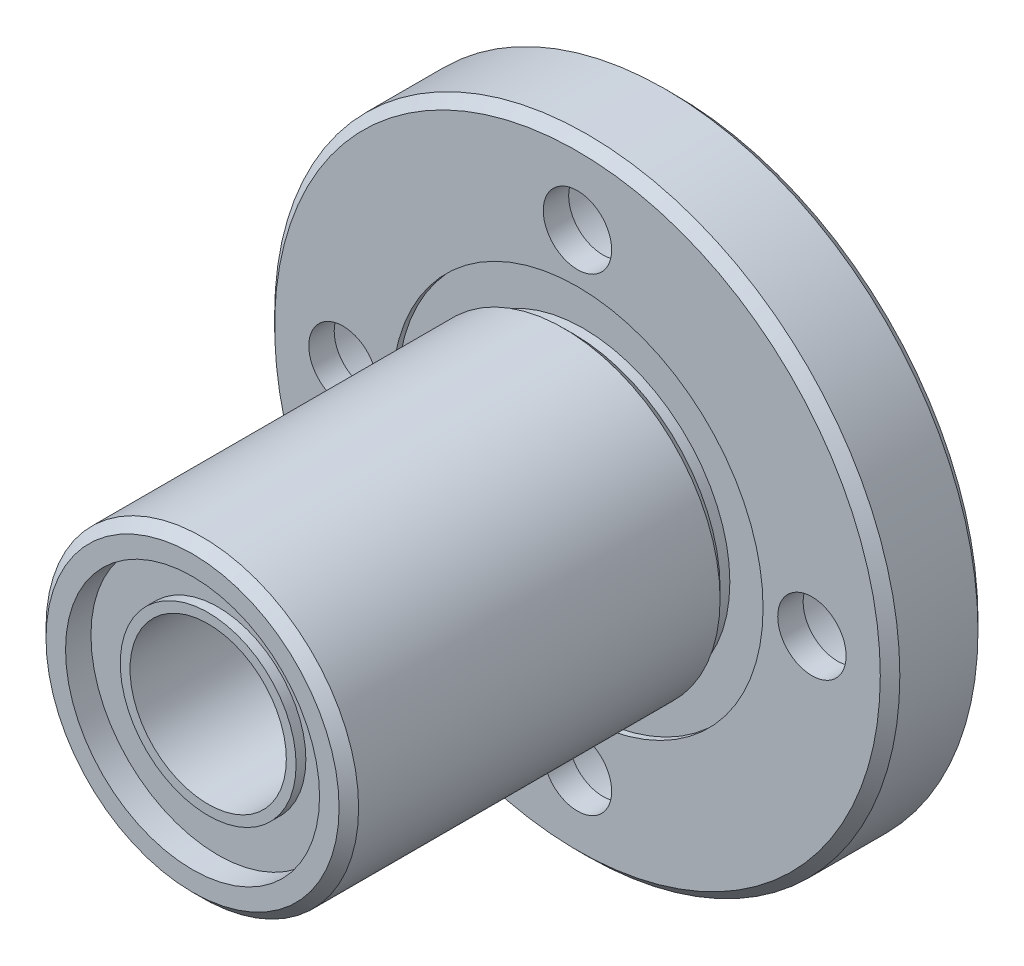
ISO-10303-21;
HEADER;
FILE_DESCRIPTION(('STEP AP214'),'2;1');
FILE_NAME('part.step','',(''),(''),'','','');
FILE_SCHEMA(('AUTOMOTIVE_DESIGN { 1 0 10303 214 1 1 1 1 }'));
ENDSEC;
DATA;
#1=APPLICATION_CONTEXT('core data for automotive mechanical design processes');
#2=APPLICATION_PROTOCOL_DEFINITION('international standard','automotive_design',2000,#1);
#3=PRODUCT_CONTEXT('',#1,'mechanical');
#4=PRODUCT('Part','Part','',(#3));
#5=PRODUCT_RELATED_PRODUCT_CATEGORY('part','',(#4));
#6=PRODUCT_DEFINITION_FORMATION('','',#4);
#7=PRODUCT_DEFINITION_CONTEXT('part definition',#1,'design');
#8=PRODUCT_DEFINITION('design','',#6,#7);
#9=PRODUCT_DEFINITION_SHAPE('','',#8);
#10=(LENGTH_UNIT() NAMED_UNIT(*) SI_UNIT(.MILLI.,.METRE.));
#11=(NAMED_UNIT(*) PLANE_ANGLE_UNIT() SI_UNIT($,.RADIAN.));
#12=(NAMED_UNIT(*) SI_UNIT($,.STERADIAN.) SOLID_ANGLE_UNIT());
#13=UNCERTAINTY_MEASURE_WITH_UNIT(LENGTH_MEASURE(1.E-05),#10,'distance_accuracy_value','');
#14=(GEOMETRIC_REPRESENTATION_CONTEXT(3) GLOBAL_UNCERTAINTY_ASSIGNED_CONTEXT((#13)) GLOBAL_UNIT_ASSIGNED_CONTEXT((#10,
#11,#12)) REPRESENTATION_CONTEXT('',''));
#15=CARTESIAN_POINT('',(0.,0.,0.));
#16=DIRECTION('',(0.,0.,1.));
#17=DIRECTION('',(1.,0.,0.));
#18=AXIS2_PLACEMENT_3D('',#15,#16,#17);
#19=CARTESIAN_POINT('',(0.,0.,23.4));
#20=DIRECTION('',(0.,0.,1.));
#21=DIRECTION('',(1.,0.,0.));
#22=AXIS2_PLACEMENT_3D('',#19,#20,#21);
#23=PLANE('',#22);
#24=CARTESIAN_POINT('',(0.,0.,23.4));
#25=DIRECTION('',(0.,0.,1.));
#26=DIRECTION('',(1.,0.,0.));
#27=AXIS2_PLACEMENT_3D('',#24,#25,#26);
#28=CIRCLE('',#27,6.5);
#29=CARTESIAN_POINT('',(6.5,0.,23.4));
#30=VERTEX_POINT('',#29);
#31=EDGE_CURVE('E93',#30,#30,#28,.T.);
#32=ORIENTED_EDGE('',*,*,#31,.T.);
#33=EDGE_LOOP('',(#32));
#34=FACE_BOUND('',#33,.T.);
#35=CARTESIAN_POINT('',(0.,0.,23.4));
#36=DIRECTION('',(0.,0.,1.));
#37=DIRECTION('',(1.,0.,0.));
#38=AXIS2_PLACEMENT_3D('',#35,#36,#37);
#39=CIRCLE('',#38,4.5);
#40=CARTESIAN_POINT('',(4.5,0.,23.4));
#41=VERTEX_POINT('',#40);
#42=EDGE_CURVE('E143',#41,#41,#39,.T.);
#43=ORIENTED_EDGE('',*,*,#42,.F.);
#44=EDGE_LOOP('',(#43));
#45=FACE_BOUND('',#44,.T.);
#46=ADVANCED_FACE('F40',(#34,#45),#23,.T.);
#47=CARTESIAN_POINT('',(0.,0.,-0.001000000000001));
#48=DIRECTION('',(0.,0.,1.));
#49=DIRECTION('',(1.,0.,0.));
#50=AXIS2_PLACEMENT_3D('',#47,#48,#49);
#51=CYLINDRICAL_SURFACE('',#50,4.);
#52=CARTESIAN_POINT('',(0.,0.,23.9));
#53=DIRECTION('',(0.,0.,1.));
#54=DIRECTION('',(1.,0.,0.));
#55=AXIS2_PLACEMENT_3D('',#52,#53,#54);
#56=CIRCLE('',#55,4.);
#57=CARTESIAN_POINT('',(4.,0.,23.9));
#58=VERTEX_POINT('',#57);
#59=EDGE_CURVE('E146',#58,#58,#56,.T.);
#60=ORIENTED_EDGE('',*,*,#59,.T.);
#61=EDGE_LOOP('',(#60));
#62=FACE_BOUND('',#61,.T.);
#63=CARTESIAN_POINT('',(0.,0.,0.8));
#64=DIRECTION('',(0.,0.,1.));
#65=DIRECTION('',(1.,0.,0.));
#66=AXIS2_PLACEMENT_3D('',#63,#64,#65);
#67=CIRCLE('',#66,4.);
#68=CARTESIAN_POINT('',(4.,0.,0.8));
#69=VERTEX_POINT('',#68);
#70=EDGE_CURVE('E155',#69,#69,#67,.T.);
#71=ORIENTED_EDGE('',*,*,#70,.F.);
#72=EDGE_LOOP('',(#71));
#73=FACE_BOUND('',#72,.T.);
#74=ADVANCED_FACE('F164',(#62,#73),#51,.F.);
#75=CARTESIAN_POINT('',(12.,0.,24.701));
#76=DIRECTION('',(0.,0.,-1.));
#77=DIRECTION('',(-1.,0.,0.));
#78=AXIS2_PLACEMENT_3D('',#75,#76,#77);
#79=CYLINDRICAL_SURFACE('',#78,1.75);
#80=CARTESIAN_POINT('',(12.,0.,5.));
#81=DIRECTION('',(0.,0.,1.));
#82=DIRECTION('',(1.,0.,0.));
#83=AXIS2_PLACEMENT_3D('',#80,#81,#82);
#84=CIRCLE('',#83,1.75);
#85=CARTESIAN_POINT('',(13.75,0.,5.));
#86=VERTEX_POINT('',#85);
#87=EDGE_CURVE('E71',#86,#86,#84,.F.);
#88=ORIENTED_EDGE('',*,*,#87,.F.);
#89=EDGE_LOOP('',(#88));
#90=FACE_BOUND('',#89,.T.);
#91=CARTESIAN_POINT('',(12.,0.,3.7));
#92=DIRECTION('',(0.,0.,-1.));
#93=DIRECTION('',(-1.,0.,0.));
#94=AXIS2_PLACEMENT_3D('',#91,#92,#93);
#95=CIRCLE('',#94,1.75);
#96=CARTESIAN_POINT('',(10.25,0.,3.7));
#97=VERTEX_POINT('',#96);
#98=EDGE_CURVE('E87',#97,#97,#95,.T.);
#99=ORIENTED_EDGE('',*,*,#98,.T.);
#100=EDGE_LOOP('',(#99));
#101=FACE_BOUND('',#100,.T.);
#102=ADVANCED_FACE('F166',(#90,#101),#79,.F.);
#103=CARTESIAN_POINT('',(0.,-12.,24.701));
#104=DIRECTION('',(0.,0.,-1.));
#105=DIRECTION('',(-1.,0.,0.));
#106=AXIS2_PLACEMENT_3D('',#103,#104,#105);
#107=CYLINDRICAL_SURFACE('',#106,1.75);
#108=CARTESIAN_POINT('',(0.,-12.,5.));
#109=DIRECTION('',(0.,0.,1.));
#110=DIRECTION('',(1.,0.,0.));
#111=AXIS2_PLACEMENT_3D('',#108,#109,#110);
#112=CIRCLE('',#111,1.75);
#113=CARTESIAN_POINT('',(1.75,-12.,5.));
#114=VERTEX_POINT('',#113);
#115=EDGE_CURVE('E74',#114,#114,#112,.F.);
#116=ORIENTED_EDGE('',*,*,#115,.F.);
#117=EDGE_LOOP('',(#116));
#118=FACE_BOUND('',#117,.T.);
#119=CARTESIAN_POINT('',(0.,-12.,3.7));
#120=DIRECTION('',(0.,0.,-1.));
#121=DIRECTION('',(-1.,0.,0.));
#122=AXIS2_PLACEMENT_3D('',#119,#120,#121);
#123=CIRCLE('',#122,1.75);
#124=CARTESIAN_POINT('',(-1.75,-12.,3.7));
#125=VERTEX_POINT('',#124);
#126=EDGE_CURVE('E90',#125,#125,#123,.T.);
#127=ORIENTED_EDGE('',*,*,#126,.T.);
#128=EDGE_LOOP('',(#127));
#129=FACE_BOUND('',#128,.T.);
#130=ADVANCED_FACE('F173',(#118,#129),#107,.F.);
#131=CARTESIAN_POINT('',(-12.,0.,24.701));
#132=DIRECTION('',(0.,0.,-1.));
#133=DIRECTION('',(-1.,0.,0.));
#134=AXIS2_PLACEMENT_3D('',#131,#132,#133);
#135=CYLINDRICAL_SURFACE('',#134,1.75);
#136=CARTESIAN_POINT('',(-12.,0.,5.));
#137=DIRECTION('',(0.,0.,1.));
#138=DIRECTION('',(1.,0.,0.));
#139=AXIS2_PLACEMENT_3D('',#136,#137,#138);
#140=CIRCLE('',#139,1.75);
#141=CARTESIAN_POINT('',(-10.25,0.,5.));
#142=VERTEX_POINT('',#141);
#143=EDGE_CURVE('E78',#142,#142,#140,.F.);
#144=ORIENTED_EDGE('',*,*,#143,.F.);
#145=EDGE_LOOP('',(#144));
#146=FACE_BOUND('',#145,.T.);
#147=CARTESIAN_POINT('',(-12.,0.,3.7));
#148=DIRECTION('',(0.,0.,-1.));
#149=DIRECTION('',(-1.,0.,0.));
#150=AXIS2_PLACEMENT_3D('',#147,#148,#149);
#151=CIRCLE('',#150,1.75);
#152=CARTESIAN_POINT('',(-13.75,0.,3.7));
#153=VERTEX_POINT('',#152);
#154=EDGE_CURVE('E100',#153,#153,#151,.T.);
#155=ORIENTED_EDGE('',*,*,#154,.T.);
#156=EDGE_LOOP('',(#155));
#157=FACE_BOUND('',#156,.T.);
#158=ADVANCED_FACE('F485',(#146,#157),#135,.F.);
#159=CARTESIAN_POINT('',(0.,12.,24.701));
#160=DIRECTION('',(0.,0.,-1.));
#161=DIRECTION('',(-1.,0.,0.));
#162=AXIS2_PLACEMENT_3D('',#159,#160,#161);
#163=CYLINDRICAL_SURFACE('',#162,1.75);
#164=CARTESIAN_POINT('',(0.,12.,5.));
#165=DIRECTION('',(0.,0.,1.));
#166=DIRECTION('',(1.,0.,0.));
#167=AXIS2_PLACEMENT_3D('',#164,#165,#166);
#168=CIRCLE('',#167,1.75);
#169=CARTESIAN_POINT('',(1.75,12.,5.));
#170=VERTEX_POINT('',#169);
#171=EDGE_CURVE('E70',#170,#170,#168,.F.);
#172=ORIENTED_EDGE('',*,*,#171,.F.);
#173=EDGE_LOOP('',(#172));
#174=FACE_BOUND('',#173,.T.);
#175=CARTESIAN_POINT('',(0.,12.,3.7));
#176=DIRECTION('',(0.,0.,-1.));
#177=DIRECTION('',(-1.,0.,0.));
#178=AXIS2_PLACEMENT_3D('',#175,#176,#177);
#179=CIRCLE('',#178,1.75);
#180=CARTESIAN_POINT('',(-1.75,12.,3.7));
#181=VERTEX_POINT('',#180);
#182=EDGE_CURVE('E109',#181,#181,#179,.T.);
#183=ORIENTED_EDGE('',*,*,#182,.T.);
#184=EDGE_LOOP('',(#183));
#185=FACE_BOUND('',#184,.T.);
#186=ADVANCED_FACE('F198',(#174,#185),#163,.F.);
#187=CARTESIAN_POINT('',(0.,0.,5.));
#188=DIRECTION('',(0.,0.,-1.));
#189=DIRECTION('',(-1.,0.,0.));
#190=AXIS2_PLACEMENT_3D('',#187,#188,#189);
#191=CYLINDRICAL_SURFACE('',#190,16.);
#192=CARTESIAN_POINT('',(0.,0.,0.499999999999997));
#193=DIRECTION('',(0.,0.,1.));
#194=DIRECTION('',(1.,0.,0.));
#195=AXIS2_PLACEMENT_3D('',#192,#193,#194);
#196=CIRCLE('',#195,16.);
#197=CARTESIAN_POINT('',(16.,0.,0.499999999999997));
#198=VERTEX_POINT('',#197);
#199=EDGE_CURVE('E52',#198,#198,#196,.T.);
#200=ORIENTED_EDGE('',*,*,#199,.T.);
#201=EDGE_LOOP('',(#200));
#202=FACE_BOUND('',#201,.T.);
#203=CARTESIAN_POINT('',(0.,0.,4.49999999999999));
#204=DIRECTION('',(0.,0.,1.));
#205=DIRECTION('',(1.,0.,0.));
#206=AXIS2_PLACEMENT_3D('',#203,#204,#205);
#207=CIRCLE('',#206,16.);
#208=CARTESIAN_POINT('',(16.,0.,4.49999999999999));
#209=VERTEX_POINT('',#208);
#210=EDGE_CURVE('E56',#209,#209,#207,.F.);
#211=ORIENTED_EDGE('',*,*,#210,.T.);
#212=EDGE_LOOP('',(#211));
#213=FACE_BOUND('',#212,.T.);
#214=ADVANCED_FACE('F193',(#202,#213),#191,.T.);
#215=CARTESIAN_POINT('',(0.,0.,5.));
#216=DIRECTION('',(0.,0.,1.));
#217=DIRECTION('',(1.,0.,0.));
#218=AXIS2_PLACEMENT_3D('',#215,#216,#217);
#219=PLANE('',#218);
#220=CARTESIAN_POINT('',(0.,0.,5.));
#221=DIRECTION('',(0.,0.,1.));
#222=DIRECTION('',(1.,0.,0.));
#223=AXIS2_PLACEMENT_3D('',#220,#221,#222);
#224=CIRCLE('',#223,15.5);
#225=CARTESIAN_POINT('',(15.5,0.,5.));
#226=VERTEX_POINT('',#225);
#227=EDGE_CURVE('E11',#226,#226,#224,.T.);
#228=ORIENTED_EDGE('',*,*,#227,.T.);
#229=EDGE_LOOP('',(#228));
#230=FACE_BOUND('',#229,.T.);
#231=CARTESIAN_POINT('',(0.,0.,5.));
#232=DIRECTION('',(0.,0.,1.));
#233=DIRECTION('',(1.,0.,0.));
#234=AXIS2_PLACEMENT_3D('',#231,#232,#233);
#235=CIRCLE('',#234,9.5);
#236=CARTESIAN_POINT('',(9.5,0.,5.));
#237=VERTEX_POINT('',#236);
#238=EDGE_CURVE('E131',#237,#237,#235,.T.);
#239=ORIENTED_EDGE('',*,*,#238,.F.);
#240=EDGE_LOOP('',(#239));
#241=FACE_BOUND('',#240,.T.);
#242=ORIENTED_EDGE('',*,*,#171,.T.);
#243=EDGE_LOOP('',(#242));
#244=FACE_BOUND('',#243,.T.);
#245=ORIENTED_EDGE('',*,*,#143,.T.);
#246=EDGE_LOOP('',(#245));
#247=FACE_BOUND('',#246,.T.);
#248=ORIENTED_EDGE('',*,*,#115,.T.);
#249=EDGE_LOOP('',(#248));
#250=FACE_BOUND('',#249,.T.);
#251=ORIENTED_EDGE('',*,*,#87,.T.);
#252=EDGE_LOOP('',(#251));
#253=FACE_BOUND('',#252,.T.);
#254=ADVANCED_FACE('F190',(#230,#241,#244,#247,#250,#253),#219,.T.);
#255=CARTESIAN_POINT('',(0.,0.,0.));
#256=DIRECTION('',(0.,0.,1.));
#257=DIRECTION('',(1.,0.,0.));
#258=AXIS2_PLACEMENT_3D('',#255,#256,#257);
#259=PLANE('',#258);
#260=CARTESIAN_POINT('',(0.,0.,0.));
#261=DIRECTION('',(0.,0.,1.));
#262=DIRECTION('',(1.,0.,0.));
#263=AXIS2_PLACEMENT_3D('',#260,#261,#262);
#264=CIRCLE('',#263,15.5);
#265=CARTESIAN_POINT('',(15.5,0.,0.));
#266=VERTEX_POINT('',#265);
#267=EDGE_CURVE('E48',#266,#266,#264,.F.);
#268=ORIENTED_EDGE('',*,*,#267,.T.);
#269=EDGE_LOOP('',(#268));
#270=FACE_BOUND('',#269,.T.);
#271=CARTESIAN_POINT('',(0.,0.,0.));
#272=DIRECTION('',(0.,0.,1.));
#273=DIRECTION('',(1.,0.,0.));
#274=AXIS2_PLACEMENT_3D('',#271,#272,#273);
#275=CIRCLE('',#274,6.5);
#276=CARTESIAN_POINT('',(6.5,0.,0.));
#277=VERTEX_POINT('',#276);
#278=EDGE_CURVE('E125',#277,#277,#275,.T.);
#279=ORIENTED_EDGE('',*,*,#278,.T.);
#280=EDGE_LOOP('',(#279));
#281=FACE_BOUND('',#280,.T.);
#282=CARTESIAN_POINT('',(0.,12.,0.));
#283=DIRECTION('',(0.,0.,-1.));
#284=DIRECTION('',(-1.,0.,0.));
#285=AXIS2_PLACEMENT_3D('',#282,#283,#284);
#286=CIRCLE('',#285,3.25);
#287=CARTESIAN_POINT('',(-3.25,12.,0.));
#288=VERTEX_POINT('',#287);
#289=EDGE_CURVE('E112',#288,#288,#286,.T.);
#290=ORIENTED_EDGE('',*,*,#289,.F.);
#291=EDGE_LOOP('',(#290));
#292=FACE_BOUND('',#291,.T.);
#293=CARTESIAN_POINT('',(-12.,0.,0.));
#294=DIRECTION('',(0.,0.,-1.));
#295=DIRECTION('',(-1.,0.,0.));
#296=AXIS2_PLACEMENT_3D('',#293,#294,#295);
#297=CIRCLE('',#296,3.25);
#298=CARTESIAN_POINT('',(-15.25,0.,0.));
#299=VERTEX_POINT('',#298);
#300=EDGE_CURVE('E103',#299,#299,#297,.T.);
#301=ORIENTED_EDGE('',*,*,#300,.F.);
#302=EDGE_LOOP('',(#301));
#303=FACE_BOUND('',#302,.T.);
#304=CARTESIAN_POINT('',(0.,-12.,0.));
#305=DIRECTION('',(0.,0.,-1.));
#306=DIRECTION('',(-1.,0.,0.));
#307=AXIS2_PLACEMENT_3D('',#304,#305,#306);
#308=CIRCLE('',#307,3.25);
#309=CARTESIAN_POINT('',(-3.25,-12.,0.));
#310=VERTEX_POINT('',#309);
#311=EDGE_CURVE('E94',#310,#310,#308,.T.);
#312=ORIENTED_EDGE('',*,*,#311,.F.);
#313=EDGE_LOOP('',(#312));
#314=FACE_BOUND('',#313,.T.);
#315=CARTESIAN_POINT('',(12.,0.,0.));
#316=DIRECTION('',(0.,0.,-1.));
#317=DIRECTION('',(-1.,0.,0.));
#318=AXIS2_PLACEMENT_3D('',#315,#316,#317);
#319=CIRCLE('',#318,3.25);
#320=CARTESIAN_POINT('',(8.75,0.,0.));
#321=VERTEX_POINT('',#320);
#322=EDGE_CURVE('E83',#321,#321,#319,.T.);
#323=ORIENTED_EDGE('',*,*,#322,.F.);
#324=EDGE_LOOP('',(#323));
#325=FACE_BOUND('',#324,.T.);
#326=ADVANCED_FACE('F188',(#270,#281,#292,#303,#314,#325),#259,.F.);
#327=CARTESIAN_POINT('',(0.,0.,24.7));
#328=DIRECTION('',(0.,0.,-1.));
#329=DIRECTION('',(-1.,0.,0.));
#330=AXIS2_PLACEMENT_3D('',#327,#328,#329);
#331=CYLINDRICAL_SURFACE('',#330,8.);
#332=CARTESIAN_POINT('',(0.,0.,24.2));
#333=DIRECTION('',(0.,0.,1.));
#334=DIRECTION('',(1.,0.,0.));
#335=AXIS2_PLACEMENT_3D('',#332,#333,#334);
#336=CIRCLE('',#335,8.);
#337=CARTESIAN_POINT('',(8.,0.,24.2));
#338=VERTEX_POINT('',#337);
#339=EDGE_CURVE('E61',#338,#338,#336,.F.);
#340=ORIENTED_EDGE('',*,*,#339,.T.);
#341=EDGE_LOOP('',(#340));
#342=FACE_BOUND('',#341,.T.);
#343=CARTESIAN_POINT('',(0.,0.,5.7));
#344=DIRECTION('',(0.,0.,1.));
#345=DIRECTION('',(1.,0.,0.));
#346=AXIS2_PLACEMENT_3D('',#343,#344,#345);
#347=CIRCLE('',#346,8.);
#348=CARTESIAN_POINT('',(8.,0.,5.7));
#349=VERTEX_POINT('',#348);
#350=EDGE_CURVE('E134',#349,#349,#347,.T.);
#351=ORIENTED_EDGE('',*,*,#350,.T.);
#352=EDGE_LOOP('',(#351));
#353=FACE_BOUND('',#352,.T.);
#354=ADVANCED_FACE('F184',(#342,#353),#331,.T.);
#355=CARTESIAN_POINT('',(0.,0.,24.7));
#356=DIRECTION('',(0.,0.,1.));
#357=DIRECTION('',(1.,0.,0.));
#358=AXIS2_PLACEMENT_3D('',#355,#356,#357);
#359=PLANE('',#358);
#360=CARTESIAN_POINT('',(0.,0.,24.7));
#361=DIRECTION('',(0.,0.,1.));
#362=DIRECTION('',(1.,0.,0.));
#363=AXIS2_PLACEMENT_3D('',#360,#361,#362);
#364=CIRCLE('',#363,7.5);
#365=CARTESIAN_POINT('',(7.5,0.,24.7));
#366=VERTEX_POINT('',#365);
#367=EDGE_CURVE('E64',#366,#366,#364,.T.);
#368=ORIENTED_EDGE('',*,*,#367,.T.);
#369=EDGE_LOOP('',(#368));
#370=FACE_BOUND('',#369,.T.);
#371=CARTESIAN_POINT('',(0.,0.,24.7));
#372=DIRECTION('',(0.,0.,1.));
#373=DIRECTION('',(1.,0.,0.));
#374=AXIS2_PLACEMENT_3D('',#371,#372,#373);
#375=CIRCLE('',#374,6.5);
#376=CARTESIAN_POINT('',(6.5,0.,24.7));
#377=VERTEX_POINT('',#376);
#378=EDGE_CURVE('E119',#377,#377,#375,.T.);
#379=ORIENTED_EDGE('',*,*,#378,.F.);
#380=EDGE_LOOP('',(#379));
#381=FACE_BOUND('',#380,.T.);
#382=ADVANCED_FACE('F180',(#370,#381),#359,.T.);
#383=CARTESIAN_POINT('',(0.,12.,3.7));
#384=DIRECTION('',(0.,0.,-1.));
#385=DIRECTION('',(-1.,0.,0.));
#386=AXIS2_PLACEMENT_3D('',#383,#384,#385);
#387=CYLINDRICAL_SURFACE('',#386,3.25);
#388=CARTESIAN_POINT('',(0.,12.,3.7));
#389=DIRECTION('',(0.,0.,-1.));
#390=DIRECTION('',(-1.,0.,0.));
#391=AXIS2_PLACEMENT_3D('',#388,#389,#390);
#392=CIRCLE('',#391,3.25);
#393=CARTESIAN_POINT('',(-3.25,12.,3.7));
#394=VERTEX_POINT('',#393);
#395=EDGE_CURVE('E75',#394,#394,#392,.T.);
#396=ORIENTED_EDGE('',*,*,#395,.F.);
#397=EDGE_LOOP('',(#396));
#398=FACE_BOUND('',#397,.T.);
#399=ORIENTED_EDGE('',*,*,#289,.T.);
#400=EDGE_LOOP('',(#399));
#401=FACE_BOUND('',#400,.T.);
#402=ADVANCED_FACE('F183',(#398,#401),#387,.F.);
#403=CARTESIAN_POINT('',(0.,12.,3.7));
#404=DIRECTION('',(0.,0.,-1.));
#405=DIRECTION('',(-1.,0.,0.));
#406=AXIS2_PLACEMENT_3D('',#403,#404,#405);
#407=PLANE('',#406);
#408=ORIENTED_EDGE('',*,*,#182,.F.);
#409=EDGE_LOOP('',(#408));
#410=FACE_BOUND('',#409,.T.);
#411=ORIENTED_EDGE('',*,*,#395,.T.);
#412=EDGE_LOOP('',(#411));
#413=FACE_BOUND('',#412,.T.);
#414=ADVANCED_FACE('F459',(#410,#413),#407,.T.);
#415=CARTESIAN_POINT('',(-12.,0.,3.7));
#416=DIRECTION('',(0.,0.,-1.));
#417=DIRECTION('',(-1.,0.,0.));
#418=AXIS2_PLACEMENT_3D('',#415,#416,#417);
#419=CYLINDRICAL_SURFACE('',#418,3.25);
#420=CARTESIAN_POINT('',(-12.,0.,3.7));
#421=DIRECTION('',(0.,0.,-1.));
#422=DIRECTION('',(-1.,0.,0.));
#423=AXIS2_PLACEMENT_3D('',#420,#421,#422);
#424=CIRCLE('',#423,3.25);
#425=CARTESIAN_POINT('',(-15.25,0.,3.7));
#426=VERTEX_POINT('',#425);
#427=EDGE_CURVE('E106',#426,#426,#424,.T.);
#428=ORIENTED_EDGE('',*,*,#427,.F.);
#429=EDGE_LOOP('',(#428));
#430=FACE_BOUND('',#429,.T.);
#431=ORIENTED_EDGE('',*,*,#300,.T.);
#432=EDGE_LOOP('',(#431));
#433=FACE_BOUND('',#432,.T.);
#434=ADVANCED_FACE('F449',(#430,#433),#419,.F.);
#435=CARTESIAN_POINT('',(-12.,0.,3.7));
#436=DIRECTION('',(0.,0.,-1.));
#437=DIRECTION('',(-1.,0.,0.));
#438=AXIS2_PLACEMENT_3D('',#435,#436,#437);
#439=PLANE('',#438);
#440=ORIENTED_EDGE('',*,*,#154,.F.);
#441=EDGE_LOOP('',(#440));
#442=FACE_BOUND('',#441,.T.);
#443=ORIENTED_EDGE('',*,*,#427,.T.);
#444=EDGE_LOOP('',(#443));
#445=FACE_BOUND('',#444,.T.);
#446=ADVANCED_FACE('F439',(#442,#445),#439,.T.);
#447=CARTESIAN_POINT('',(0.,-12.,3.7));
#448=DIRECTION('',(0.,0.,-1.));
#449=DIRECTION('',(-1.,0.,0.));
#450=AXIS2_PLACEMENT_3D('',#447,#448,#449);
#451=CYLINDRICAL_SURFACE('',#450,3.25);
#452=CARTESIAN_POINT('',(0.,-12.,3.7));
#453=DIRECTION('',(0.,0.,-1.));
#454=DIRECTION('',(-1.,0.,0.));
#455=AXIS2_PLACEMENT_3D('',#452,#453,#454);
#456=CIRCLE('',#455,3.25);
#457=CARTESIAN_POINT('',(-3.25,-12.,3.7));
#458=VERTEX_POINT('',#457);
#459=EDGE_CURVE('E97',#458,#458,#456,.T.);
#460=ORIENTED_EDGE('',*,*,#459,.F.);
#461=EDGE_LOOP('',(#460));
#462=FACE_BOUND('',#461,.T.);
#463=ORIENTED_EDGE('',*,*,#311,.T.);
#464=EDGE_LOOP('',(#463));
#465=FACE_BOUND('',#464,.T.);
#466=ADVANCED_FACE('F429',(#462,#465),#451,.F.);
#467=CARTESIAN_POINT('',(0.,-12.,3.7));
#468=DIRECTION('',(0.,0.,-1.));
#469=DIRECTION('',(-1.,0.,0.));
#470=AXIS2_PLACEMENT_3D('',#467,#468,#469);
#471=PLANE('',#470);
#472=ORIENTED_EDGE('',*,*,#126,.F.);
#473=EDGE_LOOP('',(#472));
#474=FACE_BOUND('',#473,.T.);
#475=ORIENTED_EDGE('',*,*,#459,.T.);
#476=EDGE_LOOP('',(#475));
#477=FACE_BOUND('',#476,.T.);
#478=ADVANCED_FACE('F419',(#474,#477),#471,.T.);
#479=CARTESIAN_POINT('',(12.,0.,3.7));
#480=DIRECTION('',(0.,0.,-1.));
#481=DIRECTION('',(-1.,0.,0.));
#482=AXIS2_PLACEMENT_3D('',#479,#480,#481);
#483=CYLINDRICAL_SURFACE('',#482,3.25);
#484=CARTESIAN_POINT('',(12.,0.,3.7));
#485=DIRECTION('',(0.,0.,-1.));
#486=DIRECTION('',(-1.,0.,0.));
#487=AXIS2_PLACEMENT_3D('',#484,#485,#486);
#488=CIRCLE('',#487,3.25);
#489=CARTESIAN_POINT('',(8.75,0.,3.7));
#490=VERTEX_POINT('',#489);
#491=EDGE_CURVE('E86',#490,#490,#488,.T.);
#492=ORIENTED_EDGE('',*,*,#491,.F.);
#493=EDGE_LOOP('',(#492));
#494=FACE_BOUND('',#493,.T.);
#495=ORIENTED_EDGE('',*,*,#322,.T.);
#496=EDGE_LOOP('',(#495));
#497=FACE_BOUND('',#496,.T.);
#498=ADVANCED_FACE('F409',(#494,#497),#483,.F.);
#499=CARTESIAN_POINT('',(12.,0.,3.7));
#500=DIRECTION('',(0.,0.,-1.));
#501=DIRECTION('',(-1.,0.,0.));
#502=AXIS2_PLACEMENT_3D('',#499,#500,#501);
#503=PLANE('',#502);
#504=ORIENTED_EDGE('',*,*,#98,.F.);
#505=EDGE_LOOP('',(#504));
#506=FACE_BOUND('',#505,.T.);
#507=ORIENTED_EDGE('',*,*,#491,.T.);
#508=EDGE_LOOP('',(#507));
#509=FACE_BOUND('',#508,.T.);
#510=ADVANCED_FACE('F398',(#506,#509),#503,.T.);
#511=CARTESIAN_POINT('',(0.,0.,23.4));
#512=DIRECTION('',(0.,0.,1.));
#513=DIRECTION('',(1.,0.,0.));
#514=AXIS2_PLACEMENT_3D('',#511,#512,#513);
#515=CYLINDRICAL_SURFACE('',#514,6.5);
#516=ORIENTED_EDGE('',*,*,#31,.F.);
#517=EDGE_LOOP('',(#516));
#518=FACE_BOUND('',#517,.T.);
#519=ORIENTED_EDGE('',*,*,#378,.T.);
#520=EDGE_LOOP('',(#519));
#521=FACE_BOUND('',#520,.T.);
#522=ADVANCED_FACE('F313',(#518,#521),#515,.F.);
#523=CARTESIAN_POINT('',(0.,0.,1.3));
#524=DIRECTION('',(0.,0.,1.));
#525=DIRECTION('',(1.,0.,0.));
#526=AXIS2_PLACEMENT_3D('',#523,#524,#525);
#527=PLANE('',#526);
#528=CARTESIAN_POINT('',(0.,0.,1.3));
#529=DIRECTION('',(0.,0.,1.));
#530=DIRECTION('',(1.,0.,0.));
#531=AXIS2_PLACEMENT_3D('',#528,#529,#530);
#532=CIRCLE('',#531,4.5);
#533=CARTESIAN_POINT('',(4.5,0.,1.3));
#534=VERTEX_POINT('',#533);
#535=EDGE_CURVE('E152',#534,#534,#532,.T.);
#536=ORIENTED_EDGE('',*,*,#535,.T.);
#537=EDGE_LOOP('',(#536));
#538=FACE_BOUND('',#537,.T.);
#539=CARTESIAN_POINT('',(0.,0.,1.3));
#540=DIRECTION('',(0.,0.,1.));
#541=DIRECTION('',(1.,0.,0.));
#542=AXIS2_PLACEMENT_3D('',#539,#540,#541);
#543=CIRCLE('',#542,6.5);
#544=CARTESIAN_POINT('',(6.5,0.,1.3));
#545=VERTEX_POINT('',#544);
#546=EDGE_CURVE('E122',#545,#545,#543,.T.);
#547=ORIENTED_EDGE('',*,*,#546,.F.);
#548=EDGE_LOOP('',(#547));
#549=FACE_BOUND('',#548,.T.);
#550=ADVANCED_FACE('F307',(#538,#549),#527,.F.);
#551=CARTESIAN_POINT('',(0.,0.,1.3));
#552=DIRECTION('',(0.,0.,-1.));
#553=DIRECTION('',(-1.,0.,0.));
#554=AXIS2_PLACEMENT_3D('',#551,#552,#553);
#555=CYLINDRICAL_SURFACE('',#554,6.5);
#556=ORIENTED_EDGE('',*,*,#546,.T.);
#557=EDGE_LOOP('',(#556));
#558=FACE_BOUND('',#557,.T.);
#559=ORIENTED_EDGE('',*,*,#278,.F.);
#560=EDGE_LOOP('',(#559));
#561=FACE_BOUND('',#560,.T.);
#562=ADVANCED_FACE('F312',(#558,#561),#555,.F.);
#563=CARTESIAN_POINT('',(0.,0.,-42.1700576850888));
#564=DIRECTION('',(0.,0.,1.));
#565=DIRECTION('',(1.,0.,0.));
#566=AXIS2_PLACEMENT_3D('',#563,#564,#565);
#567=CYLINDRICAL_SURFACE('',#566,9.5);
#568=CARTESIAN_POINT('',(0.,0.,4.7));
#569=DIRECTION('',(0.,0.,1.));
#570=DIRECTION('',(1.,0.,0.));
#571=AXIS2_PLACEMENT_3D('',#568,#569,#570);
#572=CIRCLE('',#571,9.5);
#573=CARTESIAN_POINT('',(9.5,0.,4.7));
#574=VERTEX_POINT('',#573);
#575=EDGE_CURVE('E128',#574,#574,#572,.F.);
#576=CARTESIAN_POINT('',(9.5,0.,4.7));
#577=CARTESIAN_POINT('',(9.5,0.,4.703125));
#578=CARTESIAN_POINT('',(9.5,0.,4.70625));
#579=CARTESIAN_POINT('',(9.5,0.,4.71249999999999));
#580=CARTESIAN_POINT('',(9.5,0.,4.71562499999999));
#581=CARTESIAN_POINT('',(9.5,0.,4.721875));
#582=CARTESIAN_POINT('',(9.5,0.,4.725));
#583=CARTESIAN_POINT('',(9.5,0.,4.73125));
#584=CARTESIAN_POINT('',(9.5,0.,4.734375));
#585=CARTESIAN_POINT('',(9.5,0.,4.740625));
#586=CARTESIAN_POINT('',(9.5,0.,4.74375));
#587=CARTESIAN_POINT('',(9.5,0.,4.75));
#588=CARTESIAN_POINT('',(9.5,0.,4.753125));
#589=CARTESIAN_POINT('',(9.5,0.,4.759375));
#590=CARTESIAN_POINT('',(9.5,0.,4.7625));
#591=CARTESIAN_POINT('',(9.5,0.,4.76875));
#592=CARTESIAN_POINT('',(9.5,0.,4.771875));
#593=CARTESIAN_POINT('',(9.5,0.,4.778125));
#594=CARTESIAN_POINT('',(9.5,0.,4.78125));
#595=CARTESIAN_POINT('',(9.5,0.,4.7875));
#596=CARTESIAN_POINT('',(9.5,0.,4.790625));
#597=CARTESIAN_POINT('',(9.5,0.,4.796875));
#598=CARTESIAN_POINT('',(9.5,0.,4.8));
#599=CARTESIAN_POINT('',(9.5,0.,4.80625));
#600=CARTESIAN_POINT('',(9.5,0.,4.809375));
#601=CARTESIAN_POINT('',(9.5,0.,4.815625));
#602=CARTESIAN_POINT('',(9.5,0.,4.81875));
#603=CARTESIAN_POINT('',(9.5,0.,4.825));
#604=CARTESIAN_POINT('',(9.5,0.,4.828125));
#605=CARTESIAN_POINT('',(9.5,0.,4.834375));
#606=CARTESIAN_POINT('',(9.5,0.,4.8375));
#607=CARTESIAN_POINT('',(9.5,0.,4.84375));
#608=CARTESIAN_POINT('',(9.5,0.,4.846875));
#609=CARTESIAN_POINT('',(9.5,0.,4.853125));
#610=CARTESIAN_POINT('',(9.5,0.,4.85625));
#611=CARTESIAN_POINT('',(9.5,0.,4.8625));
#612=CARTESIAN_POINT('',(9.5,0.,4.865625));
#613=CARTESIAN_POINT('',(9.5,0.,4.871875));
#614=CARTESIAN_POINT('',(9.5,0.,4.875));
#615=CARTESIAN_POINT('',(9.5,0.,4.88125));
#616=CARTESIAN_POINT('',(9.5,0.,4.884375));
#617=CARTESIAN_POINT('',(9.5,0.,4.890625));
#618=CARTESIAN_POINT('',(9.5,0.,4.89375));
#619=CARTESIAN_POINT('',(9.5,0.,4.9));
#620=CARTESIAN_POINT('',(9.5,0.,4.903125));
#621=CARTESIAN_POINT('',(9.5,0.,4.909375));
#622=CARTESIAN_POINT('',(9.5,0.,4.9125));
#623=CARTESIAN_POINT('',(9.5,0.,4.91875));
#624=CARTESIAN_POINT('',(9.5,0.,4.921875));
#625=CARTESIAN_POINT('',(9.5,0.,4.928125));
#626=CARTESIAN_POINT('',(9.5,0.,4.93125));
#627=CARTESIAN_POINT('',(9.5,0.,4.9375));
#628=CARTESIAN_POINT('',(9.5,0.,4.940625));
#629=CARTESIAN_POINT('',(9.5,0.,4.946875));
#630=CARTESIAN_POINT('',(9.5,0.,4.95));
#631=CARTESIAN_POINT('',(9.5,0.,4.95625));
#632=CARTESIAN_POINT('',(9.5,0.,4.959375));
#633=CARTESIAN_POINT('',(9.5,0.,4.965625));
#634=CARTESIAN_POINT('',(9.5,0.,4.96875));
#635=CARTESIAN_POINT('',(9.5,0.,4.975));
#636=CARTESIAN_POINT('',(9.5,0.,4.978125));
#637=CARTESIAN_POINT('',(9.5,0.,4.98437500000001));
#638=CARTESIAN_POINT('',(9.5,0.,4.98750000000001));
#639=CARTESIAN_POINT('',(9.5,0.,4.99375));
#640=CARTESIAN_POINT('',(9.5,0.,4.996875));
#641=CARTESIAN_POINT('',(9.5,0.,5.));
#642=B_SPLINE_CURVE_WITH_KNOTS('',3,(#576,#577,#578,#579,#580,#581,#582,#583,#584,#585,#586,
#587,#588,#589,#590,#591,#592,#593,#594,#595,#596,#597,#598,#599,#600,#601,#602,#603,#604,#605,
#606,#607,#608,#609,#610,#611,#612,#613,#614,#615,#616,#617,#618,#619,#620,#621,#622,#623,#624,
#625,#626,#627,#628,#629,#630,#631,#632,#633,#634,#635,#636,#637,#638,#639,#640,#641),
.UNSPECIFIED.,.F.,.F.,(4,2,2,2,2,2,2,2,2,2,2,2,2,2,2,2,2,2,2,2,2,2,2,2,2,2,2,2,2,2,2,2,4),(0.,
0.00937499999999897,0.0187499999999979,0.0281250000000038,0.0375000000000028,0.0468750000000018,
0.0562500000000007,0.0656249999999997,0.0750000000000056,0.0843750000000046,0.0937500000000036,
0.103125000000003,0.112500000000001,0.121875,0.131250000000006,0.140625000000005,
0.150000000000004,0.159375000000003,0.168750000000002,0.178125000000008,0.187500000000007,
0.196875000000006,0.206250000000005,0.215625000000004,0.225000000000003,0.234375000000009,
0.243750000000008,0.253125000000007,0.262500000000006,0.271875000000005,0.281250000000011,
0.29062500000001,0.300000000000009),.UNSPECIFIED.);
#643=EDGE_CURVE('BSEAM372',#574,#237,#642,.T.);
#644=ORIENTED_EDGE('',*,*,#575,.T.);
#645=ORIENTED_EDGE('',*,*,#238,.T.);
#646=ORIENTED_EDGE('',*,*,#643,.T.);
#647=ORIENTED_EDGE('',*,*,#643,.F.);
#648=EDGE_LOOP('',(#644,#646,#645,#647));
#649=FACE_BOUND('',#648,.T.);
#650=ADVANCED_FACE('F372',(#649),#567,.F.);
#651=CARTESIAN_POINT('',(0.,0.,4.7));
#652=DIRECTION('',(0.,0.,1.));
#653=DIRECTION('',(1.,0.,0.));
#654=AXIS2_PLACEMENT_3D('',#651,#652,#653);
#655=PLANE('',#654);
#656=ORIENTED_EDGE('',*,*,#575,.F.);
#657=EDGE_LOOP('',(#656));
#658=FACE_BOUND('',#657,.T.);
#659=CARTESIAN_POINT('',(0.,0.,4.7));
#660=DIRECTION('',(0.,0.,1.));
#661=DIRECTION('',(1.,0.,0.));
#662=AXIS2_PLACEMENT_3D('',#659,#660,#661);
#663=CIRCLE('',#662,7.5);
#664=CARTESIAN_POINT('',(7.5,0.,4.7));
#665=VERTEX_POINT('',#664);
#666=EDGE_CURVE('E139',#665,#665,#663,.T.);
#667=ORIENTED_EDGE('',*,*,#666,.F.);
#668=EDGE_LOOP('',(#667));
#669=FACE_BOUND('',#668,.T.);
#670=ADVANCED_FACE('F362',(#658,#669),#655,.T.);
#671=CARTESIAN_POINT('',(0.,0.,5.7));
#672=DIRECTION('',(0.,0.,-1.));
#673=DIRECTION('',(-1.,0.,0.));
#674=AXIS2_PLACEMENT_3D('',#671,#672,#673);
#675=CYLINDRICAL_SURFACE('',#674,7.5);
#676=CARTESIAN_POINT('',(0.,0.,5.2));
#677=DIRECTION('',(0.,0.,1.));
#678=DIRECTION('',(1.,0.,0.));
#679=AXIS2_PLACEMENT_3D('',#676,#677,#678);
#680=CIRCLE('',#679,7.5);
#681=CARTESIAN_POINT('',(7.5,0.,5.2));
#682=VERTEX_POINT('',#681);
#683=EDGE_CURVE('E67',#682,#682,#680,.F.);
#684=ORIENTED_EDGE('',*,*,#683,.T.);
#685=EDGE_LOOP('',(#684));
#686=FACE_BOUND('',#685,.T.);
#687=ORIENTED_EDGE('',*,*,#666,.T.);
#688=EDGE_LOOP('',(#687));
#689=FACE_BOUND('',#688,.T.);
#690=ADVANCED_FACE('F208',(#686,#689),#675,.T.);
#691=CARTESIAN_POINT('',(0.,0.,5.7));
#692=DIRECTION('',(0.,0.,1.));
#693=DIRECTION('',(1.,0.,0.));
#694=AXIS2_PLACEMENT_3D('',#691,#692,#693);
#695=CONICAL_SURFACE('',#694,8.,0.78539816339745);
#696=ORIENTED_EDGE('',*,*,#683,.F.);
#697=EDGE_LOOP('',(#696));
#698=FACE_BOUND('',#697,.T.);
#699=ORIENTED_EDGE('',*,*,#350,.F.);
#700=EDGE_LOOP('',(#699));
#701=FACE_BOUND('',#700,.T.);
#702=ADVANCED_FACE('F201',(#698,#701),#695,.T.);
#703=CARTESIAN_POINT('',(0.,0.,23.9));
#704=DIRECTION('',(0.,0.,1.));
#705=DIRECTION('',(1.,0.,0.));
#706=AXIS2_PLACEMENT_3D('',#703,#704,#705);
#707=PLANE('',#706);
#708=CARTESIAN_POINT('',(0.,0.,23.9));
#709=DIRECTION('',(0.,0.,1.));
#710=DIRECTION('',(1.,0.,0.));
#711=AXIS2_PLACEMENT_3D('',#708,#709,#710);
#712=CIRCLE('',#711,4.5);
#713=CARTESIAN_POINT('',(4.5,0.,23.9));
#714=VERTEX_POINT('',#713);
#715=EDGE_CURVE('E142',#714,#714,#712,.T.);
#716=ORIENTED_EDGE('',*,*,#715,.T.);
#717=EDGE_LOOP('',(#716));
#718=FACE_BOUND('',#717,.T.);
#719=ORIENTED_EDGE('',*,*,#59,.F.);
#720=EDGE_LOOP('',(#719));
#721=FACE_BOUND('',#720,.T.);
#722=ADVANCED_FACE('F207',(#718,#721),#707,.T.);
#723=CARTESIAN_POINT('',(0.,0.,23.9));
#724=DIRECTION('',(0.,0.,-1.));
#725=DIRECTION('',(-1.,0.,0.));
#726=AXIS2_PLACEMENT_3D('',#723,#724,#725);
#727=CYLINDRICAL_SURFACE('',#726,4.5);
#728=ORIENTED_EDGE('',*,*,#715,.F.);
#729=EDGE_LOOP('',(#728));
#730=FACE_BOUND('',#729,.T.);
#731=ORIENTED_EDGE('',*,*,#42,.T.);
#732=EDGE_LOOP('',(#731));
#733=FACE_BOUND('',#732,.T.);
#734=ADVANCED_FACE('F299',(#730,#733),#727,.T.);
#735=CARTESIAN_POINT('',(0.,0.,0.8));
#736=DIRECTION('',(0.,0.,1.));
#737=DIRECTION('',(1.,0.,0.));
#738=AXIS2_PLACEMENT_3D('',#735,#736,#737);
#739=CYLINDRICAL_SURFACE('',#738,4.5);
#740=CARTESIAN_POINT('',(0.,0.,0.8));
#741=DIRECTION('',(0.,0.,1.));
#742=DIRECTION('',(1.,0.,0.));
#743=AXIS2_PLACEMENT_3D('',#740,#741,#742);
#744=CIRCLE('',#743,4.5);
#745=CARTESIAN_POINT('',(4.5,0.,0.8));
#746=VERTEX_POINT('',#745);
#747=EDGE_CURVE('E151',#746,#746,#744,.T.);
#748=ORIENTED_EDGE('',*,*,#747,.T.);
#749=EDGE_LOOP('',(#748));
#750=FACE_BOUND('',#749,.T.);
#751=ORIENTED_EDGE('',*,*,#535,.F.);
#752=EDGE_LOOP('',(#751));
#753=FACE_BOUND('',#752,.T.);
#754=ADVANCED_FACE('F288',(#750,#753),#739,.T.);
#755=CARTESIAN_POINT('',(0.,0.,0.8));
#756=DIRECTION('',(0.,0.,1.));
#757=DIRECTION('',(1.,0.,0.));
#758=AXIS2_PLACEMENT_3D('',#755,#756,#757);
#759=PLANE('',#758);
#760=ORIENTED_EDGE('',*,*,#70,.T.);
#761=EDGE_LOOP('',(#760));
#762=FACE_BOUND('',#761,.T.);
#763=ORIENTED_EDGE('',*,*,#747,.F.);
#764=EDGE_LOOP('',(#763));
#765=FACE_BOUND('',#764,.T.);
#766=ADVANCED_FACE('F161',(#762,#765),#759,.F.);
#767=CARTESIAN_POINT('',(0.,0.,24.7));
#768=DIRECTION('',(0.,0.,-1.));
#769=DIRECTION('',(-1.,0.,0.));
#770=AXIS2_PLACEMENT_3D('',#767,#768,#769);
#771=CONICAL_SURFACE('',#770,7.5,0.785398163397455);
#772=ORIENTED_EDGE('',*,*,#339,.F.);
#773=EDGE_LOOP('',(#772));
#774=FACE_BOUND('',#773,.T.);
#775=ORIENTED_EDGE('',*,*,#367,.F.);
#776=EDGE_LOOP('',(#775));
#777=FACE_BOUND('',#776,.T.);
#778=ADVANCED_FACE('F210',(#774,#777),#771,.T.);
#779=CARTESIAN_POINT('',(0.,0.,0.499999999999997));
#780=DIRECTION('',(0.,0.,1.));
#781=DIRECTION('',(1.,0.,0.));
#782=AXIS2_PLACEMENT_3D('',#779,#780,#781);
#783=CONICAL_SURFACE('',#782,16.,0.785398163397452);
#784=ORIENTED_EDGE('',*,*,#267,.F.);
#785=EDGE_LOOP('',(#784));
#786=FACE_BOUND('',#785,.T.);
#787=ORIENTED_EDGE('',*,*,#199,.F.);
#788=EDGE_LOOP('',(#787));
#789=FACE_BOUND('',#788,.T.);
#790=ADVANCED_FACE('F215',(#786,#789),#783,.T.);
#791=CARTESIAN_POINT('',(0.,0.,5.));
#792=DIRECTION('',(0.,0.,-1.));
#793=DIRECTION('',(-1.,0.,0.));
#794=AXIS2_PLACEMENT_3D('',#791,#792,#793);
#795=CONICAL_SURFACE('',#794,15.5,0.785398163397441);
#796=ORIENTED_EDGE('',*,*,#210,.F.);
#797=EDGE_LOOP('',(#796));
#798=FACE_BOUND('',#797,.T.);
#799=ORIENTED_EDGE('',*,*,#227,.F.);
#800=EDGE_LOOP('',(#799));
#801=FACE_BOUND('',#800,.T.);
#802=ADVANCED_FACE('F43',(#798,#801),#795,.T.);
#803=CLOSED_SHELL('',(#46,#74,#102,#130,#158,#186,#214,#254,#326,#354,#382,#402,#414,#434,#446,
#466,#478,#498,#510,#522,#550,#562,#650,#670,#690,#702,#722,#734,#754,#766,#778,#790,#802));
#804=MANIFOLD_SOLID_BREP('B2',#803);
#805=ADVANCED_BREP_SHAPE_REPRESENTATION('',(#18,#804),#14);
#806=SHAPE_DEFINITION_REPRESENTATION(#9,#805);
ENDSEC;
END-ISO-10303-21;
